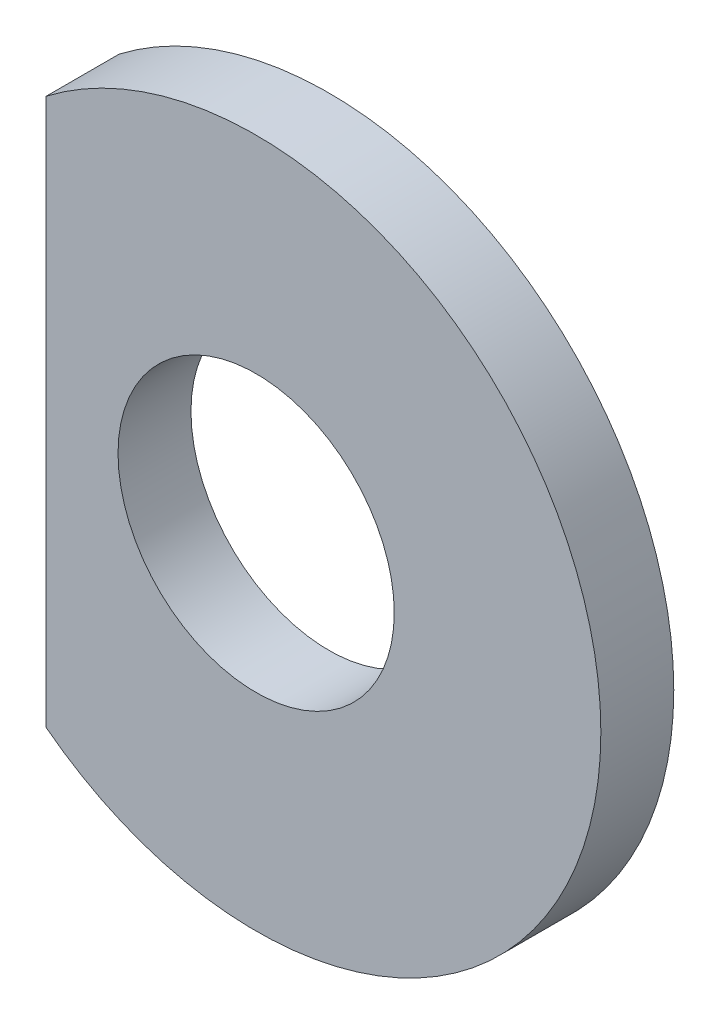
ISO-10303-21;
HEADER;
FILE_DESCRIPTION(('STEP AP214'),'2;1');
FILE_NAME('part.step','',(''),(''),'','','');
FILE_SCHEMA(('AUTOMOTIVE_DESIGN { 1 0 10303 214 1 1 1 1 }'));
ENDSEC;
DATA;
#1=APPLICATION_CONTEXT('core data for automotive mechanical design processes');
#2=APPLICATION_PROTOCOL_DEFINITION('international standard','automotive_design',2000,#1);
#3=PRODUCT_CONTEXT('',#1,'mechanical');
#4=PRODUCT('Part','Part','',(#3));
#5=PRODUCT_RELATED_PRODUCT_CATEGORY('part','',(#4));
#6=PRODUCT_DEFINITION_FORMATION('','',#4);
#7=PRODUCT_DEFINITION_CONTEXT('part definition',#1,'design');
#8=PRODUCT_DEFINITION('design','',#6,#7);
#9=PRODUCT_DEFINITION_SHAPE('','',#8);
#10=(LENGTH_UNIT() NAMED_UNIT(*) SI_UNIT(.MILLI.,.METRE.));
#11=(NAMED_UNIT(*) PLANE_ANGLE_UNIT() SI_UNIT($,.RADIAN.));
#12=(NAMED_UNIT(*) SI_UNIT($,.STERADIAN.) SOLID_ANGLE_UNIT());
#13=UNCERTAINTY_MEASURE_WITH_UNIT(LENGTH_MEASURE(1.E-05),#10,'distance_accuracy_value','');
#14=(GEOMETRIC_REPRESENTATION_CONTEXT(3) GLOBAL_UNCERTAINTY_ASSIGNED_CONTEXT((#13)) GLOBAL_UNIT_ASSIGNED_CONTEXT((#10,
#11,#12)) REPRESENTATION_CONTEXT('',''));
#15=CARTESIAN_POINT('',(0.,0.,0.));
#16=DIRECTION('',(0.,0.,1.));
#17=DIRECTION('',(1.,0.,0.));
#18=AXIS2_PLACEMENT_3D('',#15,#16,#17);
#19=CARTESIAN_POINT('',(0.,0.,-0.8382));
#20=DIRECTION('',(0.,0.,1.));
#21=DIRECTION('',(1.,0.,0.));
#22=AXIS2_PLACEMENT_3D('',#19,#20,#21);
#23=CYLINDRICAL_SURFACE('',#22,3.9624);
#24=CARTESIAN_POINT('',(0.,0.,0.));
#25=DIRECTION('',(0.,0.,1.));
#26=DIRECTION('',(1.,0.,0.));
#27=AXIS2_PLACEMENT_3D('',#24,#25,#26);
#28=CIRCLE('',#27,3.9624);
#29=CARTESIAN_POINT('',(-2.413,-3.14293569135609,0.));
#30=VERTEX_POINT('',#29);
#31=CARTESIAN_POINT('',(-2.413,3.14293569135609,0.));
#32=VERTEX_POINT('',#31);
#33=EDGE_CURVE('E63',#30,#32,#28,.T.);
#34=ORIENTED_EDGE('',*,*,#33,.F.);
#35=DIRECTION('',(0.,0.,1.));
#36=VECTOR('',#35,1.);
#37=CARTESIAN_POINT('',(-2.413,-3.14293569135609,-0.8382));
#38=LINE('',#37,#36);
#39=CARTESIAN_POINT('',(-2.413,-3.14293569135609,-0.8382));
#40=VERTEX_POINT('',#39);
#41=EDGE_CURVE('E11',#40,#30,#38,.T.);
#42=ORIENTED_EDGE('',*,*,#41,.F.);
#43=CARTESIAN_POINT('',(0.,0.,-0.8382));
#44=DIRECTION('',(0.,0.,1.));
#45=DIRECTION('',(1.,0.,0.));
#46=AXIS2_PLACEMENT_3D('',#43,#44,#45);
#47=CIRCLE('',#46,3.9624);
#48=CARTESIAN_POINT('',(-2.413,3.14293569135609,-0.8382));
#49=VERTEX_POINT('',#48);
#50=EDGE_CURVE('E68',#40,#49,#47,.T.);
#51=ORIENTED_EDGE('',*,*,#50,.T.);
#52=DIRECTION('',(0.,0.,1.));
#53=VECTOR('',#52,1.);
#54=CARTESIAN_POINT('',(-2.413,3.14293569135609,-0.8382));
#55=LINE('',#54,#53);
#56=EDGE_CURVE('E37',#49,#32,#55,.T.);
#57=ORIENTED_EDGE('',*,*,#56,.T.);
#58=EDGE_LOOP('',(#34,#42,#51,#57));
#59=FACE_BOUND('',#58,.T.);
#60=ADVANCED_FACE('F34',(#59),#23,.T.);
#61=CARTESIAN_POINT('',(-2.413,3.14293569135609,-0.8382));
#62=DIRECTION('',(-1.,0.,0.));
#63=DIRECTION('',(0.,0.,1.));
#64=AXIS2_PLACEMENT_3D('',#61,#62,#63);
#65=PLANE('',#64);
#66=DIRECTION('',(0.,-1.,0.));
#67=VECTOR('',#66,1.);
#68=CARTESIAN_POINT('',(-2.413,3.14293569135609,0.));
#69=LINE('',#68,#67);
#70=EDGE_CURVE('E60',#32,#30,#69,.T.);
#71=ORIENTED_EDGE('',*,*,#70,.F.);
#72=ORIENTED_EDGE('',*,*,#56,.F.);
#73=DIRECTION('',(0.,-1.,0.));
#74=VECTOR('',#73,1.);
#75=CARTESIAN_POINT('',(-2.413,3.14293569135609,-0.8382));
#76=LINE('',#75,#74);
#77=EDGE_CURVE('E62',#49,#40,#76,.T.);
#78=ORIENTED_EDGE('',*,*,#77,.T.);
#79=ORIENTED_EDGE('',*,*,#41,.T.);
#80=EDGE_LOOP('',(#71,#72,#78,#79));
#81=FACE_BOUND('',#80,.T.);
#82=ADVANCED_FACE('F58',(#81),#65,.T.);
#83=CARTESIAN_POINT('',(0.,0.,-0.8382));
#84=DIRECTION('',(0.,0.,1.));
#85=DIRECTION('',(1.,0.,0.));
#86=AXIS2_PLACEMENT_3D('',#83,#84,#85);
#87=PLANE('',#86);
#88=CARTESIAN_POINT('',(0.,0.,-0.8382));
#89=DIRECTION('',(0.,0.,1.));
#90=DIRECTION('',(1.,0.,0.));
#91=AXIS2_PLACEMENT_3D('',#88,#89,#90);
#92=CIRCLE('',#91,1.5875);
#93=CARTESIAN_POINT('',(1.5875,0.,-0.8382));
#94=VERTEX_POINT('',#93);
#95=EDGE_CURVE('E65',#94,#94,#92,.T.);
#96=ORIENTED_EDGE('',*,*,#95,.T.);
#97=EDGE_LOOP('',(#96));
#98=FACE_BOUND('',#97,.T.);
#99=ORIENTED_EDGE('',*,*,#50,.F.);
#100=ORIENTED_EDGE('',*,*,#77,.F.);
#101=EDGE_LOOP('',(#99,#100));
#102=FACE_BOUND('',#101,.T.);
#103=ADVANCED_FACE('F79',(#98,#102),#87,.F.);
#104=CARTESIAN_POINT('',(0.,0.,0.));
#105=DIRECTION('',(0.,0.,1.));
#106=DIRECTION('',(1.,0.,0.));
#107=AXIS2_PLACEMENT_3D('',#104,#105,#106);
#108=PLANE('',#107);
#109=CARTESIAN_POINT('',(0.,0.,0.));
#110=DIRECTION('',(0.,0.,1.));
#111=DIRECTION('',(1.,0.,0.));
#112=AXIS2_PLACEMENT_3D('',#109,#110,#111);
#113=CIRCLE('',#112,1.5875);
#114=CARTESIAN_POINT('',(1.5875,0.,0.));
#115=VERTEX_POINT('',#114);
#116=EDGE_CURVE('E73',#115,#115,#113,.T.);
#117=ORIENTED_EDGE('',*,*,#116,.F.);
#118=EDGE_LOOP('',(#117));
#119=FACE_BOUND('',#118,.T.);
#120=ORIENTED_EDGE('',*,*,#33,.T.);
#121=ORIENTED_EDGE('',*,*,#70,.T.);
#122=EDGE_LOOP('',(#120,#121));
#123=FACE_BOUND('',#122,.T.);
#124=ADVANCED_FACE('F67',(#119,#123),#108,.T.);
#125=CARTESIAN_POINT('',(0.,0.,-0.8382));
#126=DIRECTION('',(0.,0.,1.));
#127=DIRECTION('',(1.,0.,0.));
#128=AXIS2_PLACEMENT_3D('',#125,#126,#127);
#129=CYLINDRICAL_SURFACE('',#128,1.5875);
#130=ORIENTED_EDGE('',*,*,#95,.F.);
#131=EDGE_LOOP('',(#130));
#132=FACE_BOUND('',#131,.T.);
#133=ORIENTED_EDGE('',*,*,#116,.T.);
#134=EDGE_LOOP('',(#133));
#135=FACE_BOUND('',#134,.T.);
#136=ADVANCED_FACE('F82',(#132,#135),#129,.F.);
#137=CLOSED_SHELL('',(#60,#82,#103,#124,#136));
#138=MANIFOLD_SOLID_BREP('B2',#137);
#139=ADVANCED_BREP_SHAPE_REPRESENTATION('',(#18,#138),#14);
#140=SHAPE_DEFINITION_REPRESENTATION(#9,#139);
ENDSEC;
END-ISO-10303-21;
